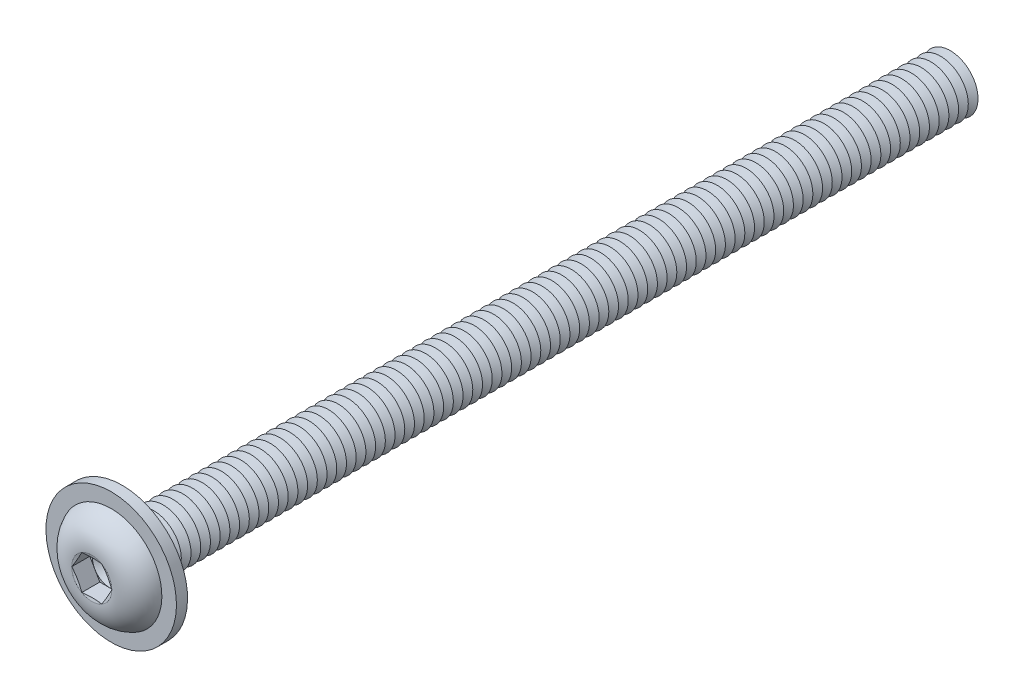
from build123d import *

# Parameters (mm, degrees)
FILLET1_R           = 0.35
LPATTERN1_COUNT     = 85
LPATTERN1_PITCH     = 0.7
CUT_EXTRUDE1_DEPTH  = 1.3
SKETCH5_R           = 4.7
SKETCH5_R_2         = 2.35
BOSS_EXTRUDE1_DEPTH = 0.8


with BuildPart() as part:
    # Sketch1 → Revolve1 (revolve)
    with BuildSketch(Plane(origin=(0, 0, 0), x_dir=(0, 0, -1), z_dir=(1, 0, 0))):
        with BuildLine():
            Line((0, 2), (0, 3.8))
            ThreePointArc((0, 3.8), (-1.611961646, 3.099623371), (-2.2, 1.443375))
            Line((-2.2, 1.443375), (-2.006624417, 0.7216875))
            Line((-2.006624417, 0.7216875), (-2.2, 0.7216875))
            Line((-2.2, 0.7216875), (-2.2, 0))
            Line((-2.2, 0), (60, 0))
            Line((60, 0), (60, 2))
            Line((60, 2), (0, 2))
        make_face()
    revolve(axis=Axis((0, 0, -60), (0, 0, 1)))

    # Fillet1
    fillet1_edges = [part.edges().sort_by_distance(p)[0] for p in [
        (0, -2, 0),
    ]]
    fillet(fillet1_edges, radius=FILLET1_R)

    # Sketch2 → Cut-Revolve1 (revolve, cut)
    with BuildSketch(Plane(origin=(0, 0, 0), x_dir=(0, 0, -1), z_dir=(1, 0, 0))):
        Polygon((59.65, 2), (60.35, 2), (60, 1.393782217), align=None)
    cut_revolve1 = revolve(axis=Axis((0, 0, -60), (0, 0, -1)), mode=Mode.SUBTRACT)

    # LPattern1: Cut-Revolve1 ×85
    with Locations(*[(0, 0, i * LPATTERN1_PITCH) for i in range(1, LPATTERN1_COUNT)]):
        add(cut_revolve1, mode=Mode.SUBTRACT)

    # Sketch3 → Cut-Extrude1 (cut)
    with BuildSketch(Plane.XY.offset(2.2)):
        Polygon((0.7216875, 1.249999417), (-0.7216875, 1.249999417), (-1.443375, 0), (-0.7216875, -1.249999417), (0.7216875, -1.249999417), (1.443375, 0), align=None)
    extrude(amount=-CUT_EXTRUDE1_DEPTH, mode=Mode.SUBTRACT)

    # Cut-Extrude2 cone 1 section (on through the dimple's axis) → Cut-Extrude2 (revolve, cut)
    with BuildSketch(Plane(origin=(0, 0, 0.9), x_dir=(0, -1, 0), z_dir=(1, 0, 0))):
        Polygon((0, 0), (1.249999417, 0), (0, 0.7216875), align=None)
    revolve(axis=Axis((0, 0, 0.9), (0, 0, -1)), mode=Mode.SUBTRACT)

    # Sketch5 → Boss-Extrude1 (add)
    with BuildSketch(Plane(origin=(0, 0, 0), x_dir=(-1, 0, 0), z_dir=(0, 0, -1))):
        with Locations(Location((0, 0, 0), (0, 0, 90))):
            Circle(SKETCH5_R)
        Circle(SKETCH5_R_2, mode=Mode.SUBTRACT)
    extrude(amount=-BOSS_EXTRUDE1_DEPTH)


solid = part.part
